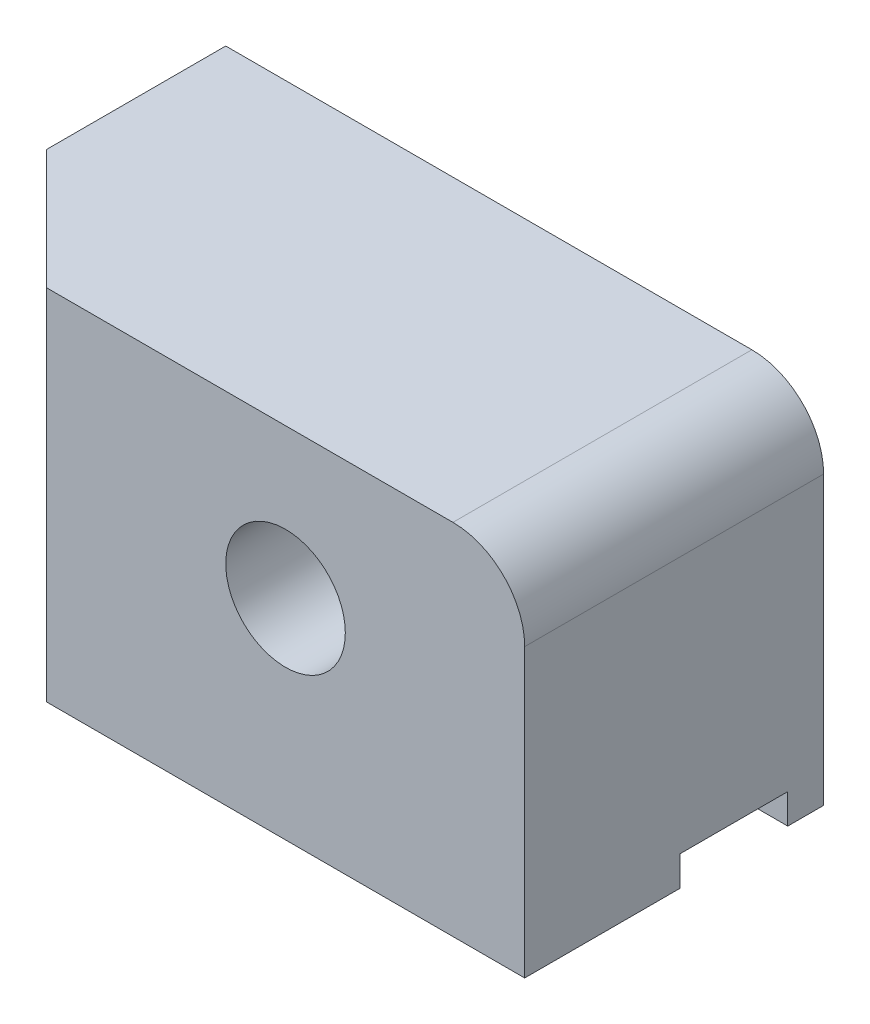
from build123d import *

# Parameters (mm, degrees)
SKETCH_1_W          = 100
SKETCH_1_H          = 60
EXTRUDE_1_DEPTH     = 50
SKETCH_2_R          = 10
CUT_EXTRUDE_1_DEPTH = 127.885775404
SKETCH_3_W          = 18
SKETCH_3_H          = 5
CUT_EXTRUDE_2_DEPTH = 127.885775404
FILLET_1_R          = 12
CHAMFER_1_SIZE      = 20


with BuildPart() as part:
    # Sketch 1 → Extrude 1 (new body)
    with BuildSketch(Plane.XY):
        with Locations((50, 30)):
            Rectangle(SKETCH_1_W, SKETCH_1_H)
    extrude(amount=EXTRUDE_1_DEPTH)

    # Sketch 2 → Cut-Extrude 1 (cut, through all)
    with BuildSketch(Plane.XY.offset(50)):
        with Locations((60, 35)):
            Circle(SKETCH_2_R)
    extrude(amount=-CUT_EXTRUDE_1_DEPTH, mode=Mode.SUBTRACT)

    # Sketch 3 → Cut-Extrude 2 (cut, through all)
    with BuildSketch(Plane(origin=(100, 0, 0), x_dir=(0, 0, -1), z_dir=(1, 0, 0))):
        with Locations((-15, 2.5)):
            Rectangle(SKETCH_3_W, SKETCH_3_H)
    extrude(amount=-CUT_EXTRUDE_2_DEPTH, mode=Mode.SUBTRACT)

    # Fillet 1
    fillet_1_edges = [part.edges().sort_by_distance(p)[0] for p in [
        (100, 60, 25),
    ]]
    fillet(fillet_1_edges, radius=FILLET_1_R)

    # Chamfer 1
    chamfer_1_edges = [part.edges().sort_by_distance(p)[0] for p in [
        (0, 30, 50),
    ]]
    chamfer(chamfer_1_edges, length=CHAMFER_1_SIZE)


solid = part.part
